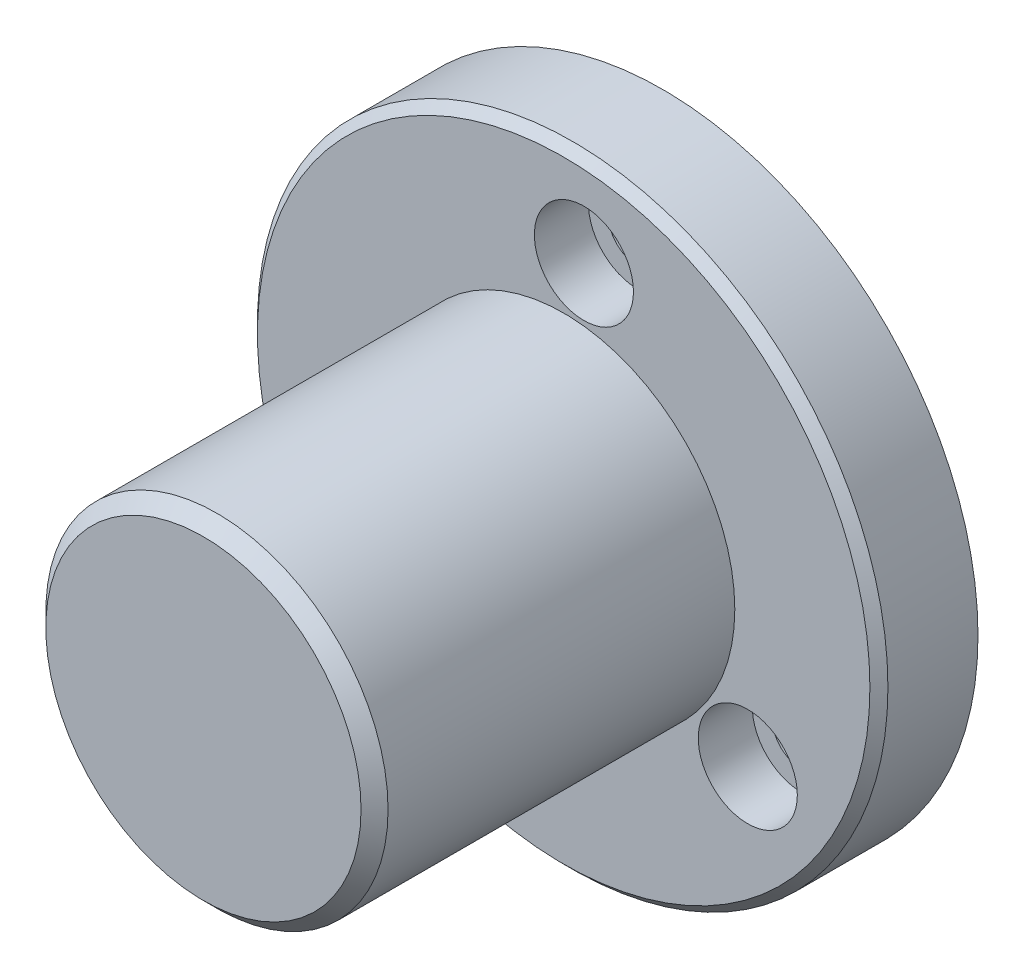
from build123d import *

# Parameters (mm, degrees)
ESQUISSE1_R                                     = 35
EXTRUSION1_DEPTH                                = 11
ESQUISSE2_R                                     = 19
EXTRUSION2_DEPTH                                = 40
CHANFREIN1_SIZE                                 = 1.5
CHANFREIN2_SIZE                                 = 1
CHAMBRAGE_POUR_VIS_T_TE_CYLINDRIQUE_D           = 6.6
CHAMBRAGE_POUR_VIS_T_TE_CYLINDRIQUE_CBORE_D     = 11
CHAMBRAGE_POUR_VIS_T_TE_CYLINDRIQUE_CBORE_DEPTH = 6


with BuildPart() as part:
    # Esquisse1 → Extrusion1 (new body)
    with BuildSketch(Plane.XY):
        Circle(ESQUISSE1_R)
    extrude(amount=EXTRUSION1_DEPTH)

    # Esquisse2 → Extrusion2 (add)
    with BuildSketch(Plane.XY.offset(11)):
        Circle(ESQUISSE2_R)
    extrude(amount=EXTRUSION2_DEPTH)

    # Chanfrein1
    chanfrein1_edges = [part.edges().sort_by_distance(p)[0] for p in [
        (-19, 0, 51),
    ]]
    chamfer(chanfrein1_edges, length=CHANFREIN1_SIZE)

    # Chanfrein2
    chanfrein2_edges = [part.edges().sort_by_distance(p)[0] for p in [
        (-35, 0, 11),
    ]]
    chamfer(chanfrein2_edges, length=CHANFREIN2_SIZE)

    # Chambrage pour vis _ t_te cylindrique (through all)
    with Locations(Plane.XY.offset(11)):
        with Locations((20.440258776, -14.394298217), (-22.685957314, -10.504634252), (2.245698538, 24.898932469)):
            CounterBoreHole(CHAMBRAGE_POUR_VIS_T_TE_CYLINDRIQUE_D / 2, CHAMBRAGE_POUR_VIS_T_TE_CYLINDRIQUE_CBORE_D / 2, CHAMBRAGE_POUR_VIS_T_TE_CYLINDRIQUE_CBORE_DEPTH)


solid = part.part
